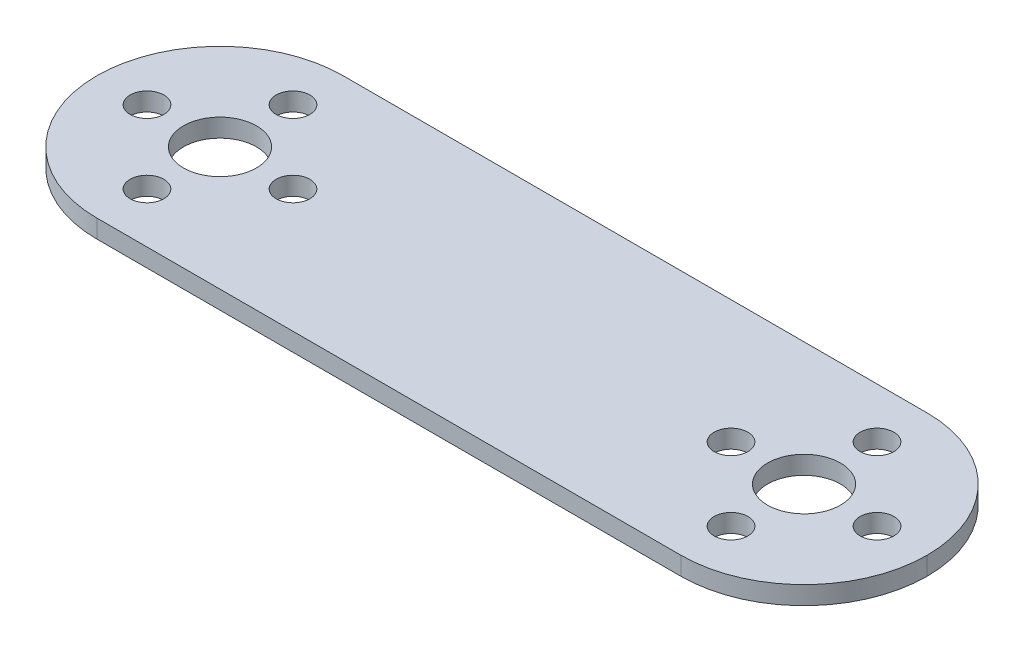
ISO-10303-21;
HEADER;
FILE_DESCRIPTION(('STEP AP214'),'2;1');
FILE_NAME('part.step','',(''),(''),'','','');
FILE_SCHEMA(('AUTOMOTIVE_DESIGN { 1 0 10303 214 1 1 1 1 }'));
ENDSEC;
DATA;
#1=APPLICATION_CONTEXT('core data for automotive mechanical design processes');
#2=APPLICATION_PROTOCOL_DEFINITION('international standard','automotive_design',2000,#1);
#3=PRODUCT_CONTEXT('',#1,'mechanical');
#4=PRODUCT('Part','Part','',(#3));
#5=PRODUCT_RELATED_PRODUCT_CATEGORY('part','',(#4));
#6=PRODUCT_DEFINITION_FORMATION('','',#4);
#7=PRODUCT_DEFINITION_CONTEXT('part definition',#1,'design');
#8=PRODUCT_DEFINITION('design','',#6,#7);
#9=PRODUCT_DEFINITION_SHAPE('','',#8);
#10=(LENGTH_UNIT() NAMED_UNIT(*) SI_UNIT(.MILLI.,.METRE.));
#11=(NAMED_UNIT(*) PLANE_ANGLE_UNIT() SI_UNIT($,.RADIAN.));
#12=(NAMED_UNIT(*) SI_UNIT($,.STERADIAN.) SOLID_ANGLE_UNIT());
#13=UNCERTAINTY_MEASURE_WITH_UNIT(LENGTH_MEASURE(1.E-05),#10,'distance_accuracy_value','');
#14=(GEOMETRIC_REPRESENTATION_CONTEXT(3) GLOBAL_UNCERTAINTY_ASSIGNED_CONTEXT((#13)) GLOBAL_UNIT_ASSIGNED_CONTEXT((#10,
#11,#12)) REPRESENTATION_CONTEXT('',''));
#15=CARTESIAN_POINT('',(0.,0.,0.));
#16=DIRECTION('',(0.,0.,1.));
#17=DIRECTION('',(1.,0.,0.));
#18=AXIS2_PLACEMENT_3D('',#15,#16,#17);
#19=CARTESIAN_POINT('',(0.,2.,0.));
#20=DIRECTION('',(0.,0.,-1.));
#21=DIRECTION('',(-1.,0.,0.));
#22=AXIS2_PLACEMENT_3D('',#19,#20,#21);
#23=PLANE('',#22);
#24=DIRECTION('',(1.,0.,0.));
#25=VECTOR('',#24,1.);
#26=CARTESIAN_POINT('',(0.,2.,0.));
#27=LINE('',#26,#25);
#28=CARTESIAN_POINT('',(13.5,2.,0.));
#29=VERTEX_POINT('',#28);
#30=CARTESIAN_POINT('',(77.5,2.,0.));
#31=VERTEX_POINT('',#30);
#32=EDGE_CURVE('E110',#29,#31,#27,.T.);
#33=ORIENTED_EDGE('',*,*,#32,.F.);
#34=DIRECTION('',(0.,-1.,0.));
#35=VECTOR('',#34,1.);
#36=CARTESIAN_POINT('',(13.5,2.,0.));
#37=LINE('',#36,#35);
#38=CARTESIAN_POINT('',(13.5,0.,0.));
#39=VERTEX_POINT('',#38);
#40=EDGE_CURVE('E128',#29,#39,#37,.T.);
#41=ORIENTED_EDGE('',*,*,#40,.T.);
#42=DIRECTION('',(1.,0.,0.));
#43=VECTOR('',#42,1.);
#44=CARTESIAN_POINT('',(0.,0.,0.));
#45=LINE('',#44,#43);
#46=CARTESIAN_POINT('',(77.5,0.,0.));
#47=VERTEX_POINT('',#46);
#48=EDGE_CURVE('E130',#39,#47,#45,.T.);
#49=ORIENTED_EDGE('',*,*,#48,.T.);
#50=DIRECTION('',(0.,-1.,0.));
#51=VECTOR('',#50,1.);
#52=CARTESIAN_POINT('',(77.5,2.,0.));
#53=LINE('',#52,#51);
#54=EDGE_CURVE('E104',#47,#31,#53,.F.);
#55=ORIENTED_EDGE('',*,*,#54,.T.);
#56=EDGE_LOOP('',(#33,#41,#49,#55));
#57=FACE_BOUND('',#56,.T.);
#58=ADVANCED_FACE('F31',(#57),#23,.F.);
#59=CARTESIAN_POINT('',(0.,2.,-27.));
#60=DIRECTION('',(0.,0.,1.));
#61=DIRECTION('',(1.,0.,0.));
#62=AXIS2_PLACEMENT_3D('',#59,#60,#61);
#63=PLANE('',#62);
#64=DIRECTION('',(-1.,0.,0.));
#65=VECTOR('',#64,1.);
#66=CARTESIAN_POINT('',(0.,0.,-27.));
#67=LINE('',#66,#65);
#68=CARTESIAN_POINT('',(77.5,0.,-27.));
#69=VERTEX_POINT('',#68);
#70=CARTESIAN_POINT('',(13.5,0.,-27.));
#71=VERTEX_POINT('',#70);
#72=EDGE_CURVE('E89',#69,#71,#67,.T.);
#73=ORIENTED_EDGE('',*,*,#72,.T.);
#74=DIRECTION('',(0.,-1.,0.));
#75=VECTOR('',#74,1.);
#76=CARTESIAN_POINT('',(13.5,2.,-27.));
#77=LINE('',#76,#75);
#78=CARTESIAN_POINT('',(13.5,2.,-27.));
#79=VERTEX_POINT('',#78);
#80=EDGE_CURVE('E124',#71,#79,#77,.F.);
#81=ORIENTED_EDGE('',*,*,#80,.T.);
#82=DIRECTION('',(-1.,0.,0.));
#83=VECTOR('',#82,1.);
#84=CARTESIAN_POINT('',(0.,2.,-27.));
#85=LINE('',#84,#83);
#86=CARTESIAN_POINT('',(77.5,2.,-27.));
#87=VERTEX_POINT('',#86);
#88=EDGE_CURVE('E107',#87,#79,#85,.T.);
#89=ORIENTED_EDGE('',*,*,#88,.F.);
#90=DIRECTION('',(0.,-1.,0.));
#91=VECTOR('',#90,1.);
#92=CARTESIAN_POINT('',(77.5,2.,-27.));
#93=LINE('',#92,#91);
#94=EDGE_CURVE('E95',#87,#69,#93,.T.);
#95=ORIENTED_EDGE('',*,*,#94,.T.);
#96=EDGE_LOOP('',(#73,#81,#89,#95));
#97=FACE_BOUND('',#96,.T.);
#98=ADVANCED_FACE('F214',(#97),#63,.F.);
#99=CARTESIAN_POINT('',(0.,2.,-27.));
#100=DIRECTION('',(0.,-1.,0.));
#101=DIRECTION('',(0.,0.,-1.));
#102=AXIS2_PLACEMENT_3D('',#99,#100,#101);
#103=PLANE('',#102);
#104=CARTESIAN_POINT('',(77.5,2.,-21.5));
#105=DIRECTION('',(0.,1.,0.));
#106=DIRECTION('',(0.,0.,1.));
#107=AXIS2_PLACEMENT_3D('',#104,#105,#106);
#108=CIRCLE('',#107,1.84999999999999);
#109=CARTESIAN_POINT('',(77.5,2.,-19.65));
#110=VERTEX_POINT('',#109);
#111=EDGE_CURVE('E196',#110,#110,#108,.T.);
#112=ORIENTED_EDGE('',*,*,#111,.F.);
#113=EDGE_LOOP('',(#112));
#114=FACE_BOUND('',#113,.T.);
#115=CARTESIAN_POINT('',(77.5,2.,-5.5));
#116=DIRECTION('',(0.,1.,0.));
#117=DIRECTION('',(0.,0.,1.));
#118=AXIS2_PLACEMENT_3D('',#115,#116,#117);
#119=CIRCLE('',#118,1.84999999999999);
#120=CARTESIAN_POINT('',(77.5,2.,-3.65000000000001));
#121=VERTEX_POINT('',#120);
#122=EDGE_CURVE('E190',#121,#121,#119,.T.);
#123=ORIENTED_EDGE('',*,*,#122,.F.);
#124=EDGE_LOOP('',(#123));
#125=FACE_BOUND('',#124,.T.);
#126=CARTESIAN_POINT('',(69.5,2.,-13.5));
#127=DIRECTION('',(0.,1.,0.));
#128=DIRECTION('',(0.,0.,1.));
#129=AXIS2_PLACEMENT_3D('',#126,#127,#128);
#130=CIRCLE('',#129,1.84999999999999);
#131=CARTESIAN_POINT('',(69.5,2.,-11.65));
#132=VERTEX_POINT('',#131);
#133=EDGE_CURVE('E184',#132,#132,#130,.T.);
#134=ORIENTED_EDGE('',*,*,#133,.F.);
#135=EDGE_LOOP('',(#134));
#136=FACE_BOUND('',#135,.T.);
#137=CARTESIAN_POINT('',(85.5,2.,-13.5));
#138=DIRECTION('',(0.,1.,0.));
#139=DIRECTION('',(0.,0.,1.));
#140=AXIS2_PLACEMENT_3D('',#137,#138,#139);
#141=CIRCLE('',#140,1.85);
#142=CARTESIAN_POINT('',(85.5,2.,-11.65));
#143=VERTEX_POINT('',#142);
#144=EDGE_CURVE('E178',#143,#143,#141,.T.);
#145=ORIENTED_EDGE('',*,*,#144,.F.);
#146=EDGE_LOOP('',(#145));
#147=FACE_BOUND('',#146,.T.);
#148=CARTESIAN_POINT('',(77.5,2.,-13.5));
#149=DIRECTION('',(0.,1.,0.));
#150=DIRECTION('',(0.,0.,1.));
#151=AXIS2_PLACEMENT_3D('',#148,#149,#150);
#152=CIRCLE('',#151,4.);
#153=CARTESIAN_POINT('',(77.5,2.,-9.49999999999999));
#154=VERTEX_POINT('',#153);
#155=EDGE_CURVE('E172',#154,#154,#152,.T.);
#156=ORIENTED_EDGE('',*,*,#155,.F.);
#157=EDGE_LOOP('',(#156));
#158=FACE_BOUND('',#157,.T.);
#159=CARTESIAN_POINT('',(13.5,2.,-21.5));
#160=DIRECTION('',(0.,1.,0.));
#161=DIRECTION('',(0.,0.,1.));
#162=AXIS2_PLACEMENT_3D('',#159,#160,#161);
#163=CIRCLE('',#162,1.85);
#164=CARTESIAN_POINT('',(13.5,2.,-19.65));
#165=VERTEX_POINT('',#164);
#166=EDGE_CURVE('E166',#165,#165,#163,.T.);
#167=ORIENTED_EDGE('',*,*,#166,.F.);
#168=EDGE_LOOP('',(#167));
#169=FACE_BOUND('',#168,.T.);
#170=CARTESIAN_POINT('',(13.5,2.,-5.5));
#171=DIRECTION('',(0.,1.,0.));
#172=DIRECTION('',(0.,0.,1.));
#173=AXIS2_PLACEMENT_3D('',#170,#171,#172);
#174=CIRCLE('',#173,1.85);
#175=CARTESIAN_POINT('',(13.5,2.,-3.65));
#176=VERTEX_POINT('',#175);
#177=EDGE_CURVE('E160',#176,#176,#174,.T.);
#178=ORIENTED_EDGE('',*,*,#177,.F.);
#179=EDGE_LOOP('',(#178));
#180=FACE_BOUND('',#179,.T.);
#181=CARTESIAN_POINT('',(5.5,2.,-13.5));
#182=DIRECTION('',(0.,1.,0.));
#183=DIRECTION('',(0.,0.,1.));
#184=AXIS2_PLACEMENT_3D('',#181,#182,#183);
#185=CIRCLE('',#184,1.85);
#186=CARTESIAN_POINT('',(5.5,2.,-11.65));
#187=VERTEX_POINT('',#186);
#188=EDGE_CURVE('E154',#187,#187,#185,.T.);
#189=ORIENTED_EDGE('',*,*,#188,.F.);
#190=EDGE_LOOP('',(#189));
#191=FACE_BOUND('',#190,.T.);
#192=CARTESIAN_POINT('',(21.5,2.,-13.5));
#193=DIRECTION('',(0.,1.,0.));
#194=DIRECTION('',(0.,0.,1.));
#195=AXIS2_PLACEMENT_3D('',#192,#193,#194);
#196=CIRCLE('',#195,1.85);
#197=CARTESIAN_POINT('',(21.5,2.,-11.65));
#198=VERTEX_POINT('',#197);
#199=EDGE_CURVE('E148',#198,#198,#196,.T.);
#200=ORIENTED_EDGE('',*,*,#199,.F.);
#201=EDGE_LOOP('',(#200));
#202=FACE_BOUND('',#201,.T.);
#203=CARTESIAN_POINT('',(13.5,2.,-13.5));
#204=DIRECTION('',(0.,1.,0.));
#205=DIRECTION('',(0.,0.,1.));
#206=AXIS2_PLACEMENT_3D('',#203,#204,#205);
#207=CIRCLE('',#206,4.);
#208=CARTESIAN_POINT('',(13.5,2.,-9.49999999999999));
#209=VERTEX_POINT('',#208);
#210=EDGE_CURVE('E139',#209,#209,#207,.T.);
#211=ORIENTED_EDGE('',*,*,#210,.F.);
#212=EDGE_LOOP('',(#211));
#213=FACE_BOUND('',#212,.T.);
#214=CARTESIAN_POINT('',(13.5,2.,-13.5));
#215=DIRECTION('',(0.,-1.,0.));
#216=DIRECTION('',(0.,0.,-1.));
#217=AXIS2_PLACEMENT_3D('',#214,#215,#216);
#218=CIRCLE('',#217,13.5);
#219=CARTESIAN_POINT('',(0.,2.,-13.5));
#220=VERTEX_POINT('',#219);
#221=EDGE_CURVE('E126',#79,#220,#218,.F.);
#222=ORIENTED_EDGE('',*,*,#221,.T.);
#223=CARTESIAN_POINT('',(13.5,2.,-13.5));
#224=DIRECTION('',(0.,-1.,0.));
#225=DIRECTION('',(0.,0.,-1.));
#226=AXIS2_PLACEMENT_3D('',#223,#224,#225);
#227=CIRCLE('',#226,13.5);
#228=EDGE_CURVE('E11',#220,#29,#227,.F.);
#229=ORIENTED_EDGE('',*,*,#228,.T.);
#230=ORIENTED_EDGE('',*,*,#32,.T.);
#231=CARTESIAN_POINT('',(77.5,2.,-13.5));
#232=DIRECTION('',(0.,-1.,0.));
#233=DIRECTION('',(0.,0.,-1.));
#234=AXIS2_PLACEMENT_3D('',#231,#232,#233);
#235=CIRCLE('',#234,13.5);
#236=CARTESIAN_POINT('',(91.,2.,-13.5));
#237=VERTEX_POINT('',#236);
#238=EDGE_CURVE('E116',#31,#237,#235,.F.);
#239=ORIENTED_EDGE('',*,*,#238,.T.);
#240=CARTESIAN_POINT('',(77.5,2.,-13.5));
#241=DIRECTION('',(0.,-1.,0.));
#242=DIRECTION('',(0.,0.,-1.));
#243=AXIS2_PLACEMENT_3D('',#240,#241,#242);
#244=CIRCLE('',#243,13.5);
#245=EDGE_CURVE('E94',#237,#87,#244,.F.);
#246=ORIENTED_EDGE('',*,*,#245,.T.);
#247=ORIENTED_EDGE('',*,*,#88,.T.);
#248=EDGE_LOOP('',(#222,#229,#230,#239,#246,#247));
#249=FACE_BOUND('',#248,.T.);
#250=ADVANCED_FACE('F211',(#114,#125,#136,#147,#158,#169,#180,#191,#202,#213,#249),#103,.F.);
#251=CARTESIAN_POINT('',(0.,0.,-27.));
#252=DIRECTION('',(0.,-1.,0.));
#253=DIRECTION('',(0.,0.,-1.));
#254=AXIS2_PLACEMENT_3D('',#251,#252,#253);
#255=PLANE('',#254);
#256=CARTESIAN_POINT('',(77.5,0.,-21.5));
#257=DIRECTION('',(0.,1.,0.));
#258=DIRECTION('',(0.,0.,1.));
#259=AXIS2_PLACEMENT_3D('',#256,#257,#258);
#260=CIRCLE('',#259,1.84999999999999);
#261=CARTESIAN_POINT('',(77.5,0.,-19.65));
#262=VERTEX_POINT('',#261);
#263=EDGE_CURVE('E193',#262,#262,#260,.T.);
#264=ORIENTED_EDGE('',*,*,#263,.T.);
#265=EDGE_LOOP('',(#264));
#266=FACE_BOUND('',#265,.T.);
#267=CARTESIAN_POINT('',(77.5,0.,-5.5));
#268=DIRECTION('',(0.,1.,0.));
#269=DIRECTION('',(0.,0.,1.));
#270=AXIS2_PLACEMENT_3D('',#267,#268,#269);
#271=CIRCLE('',#270,1.84999999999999);
#272=CARTESIAN_POINT('',(77.5,0.,-3.65000000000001));
#273=VERTEX_POINT('',#272);
#274=EDGE_CURVE('E187',#273,#273,#271,.T.);
#275=ORIENTED_EDGE('',*,*,#274,.T.);
#276=EDGE_LOOP('',(#275));
#277=FACE_BOUND('',#276,.T.);
#278=CARTESIAN_POINT('',(69.5,0.,-13.5));
#279=DIRECTION('',(0.,1.,0.));
#280=DIRECTION('',(0.,0.,1.));
#281=AXIS2_PLACEMENT_3D('',#278,#279,#280);
#282=CIRCLE('',#281,1.84999999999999);
#283=CARTESIAN_POINT('',(69.5,0.,-11.65));
#284=VERTEX_POINT('',#283);
#285=EDGE_CURVE('E181',#284,#284,#282,.T.);
#286=ORIENTED_EDGE('',*,*,#285,.T.);
#287=EDGE_LOOP('',(#286));
#288=FACE_BOUND('',#287,.T.);
#289=CARTESIAN_POINT('',(85.5,0.,-13.5));
#290=DIRECTION('',(0.,1.,0.));
#291=DIRECTION('',(0.,0.,1.));
#292=AXIS2_PLACEMENT_3D('',#289,#290,#291);
#293=CIRCLE('',#292,1.85);
#294=CARTESIAN_POINT('',(85.5,0.,-11.65));
#295=VERTEX_POINT('',#294);
#296=EDGE_CURVE('E175',#295,#295,#293,.T.);
#297=ORIENTED_EDGE('',*,*,#296,.T.);
#298=EDGE_LOOP('',(#297));
#299=FACE_BOUND('',#298,.T.);
#300=CARTESIAN_POINT('',(77.5,0.,-13.5));
#301=DIRECTION('',(0.,1.,0.));
#302=DIRECTION('',(0.,0.,1.));
#303=AXIS2_PLACEMENT_3D('',#300,#301,#302);
#304=CIRCLE('',#303,4.);
#305=CARTESIAN_POINT('',(77.5,0.,-9.49999999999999));
#306=VERTEX_POINT('',#305);
#307=EDGE_CURVE('E169',#306,#306,#304,.T.);
#308=ORIENTED_EDGE('',*,*,#307,.T.);
#309=EDGE_LOOP('',(#308));
#310=FACE_BOUND('',#309,.T.);
#311=CARTESIAN_POINT('',(13.5,0.,-21.5));
#312=DIRECTION('',(0.,1.,0.));
#313=DIRECTION('',(0.,0.,1.));
#314=AXIS2_PLACEMENT_3D('',#311,#312,#313);
#315=CIRCLE('',#314,1.85);
#316=CARTESIAN_POINT('',(13.5,0.,-19.65));
#317=VERTEX_POINT('',#316);
#318=EDGE_CURVE('E163',#317,#317,#315,.T.);
#319=ORIENTED_EDGE('',*,*,#318,.T.);
#320=EDGE_LOOP('',(#319));
#321=FACE_BOUND('',#320,.T.);
#322=CARTESIAN_POINT('',(13.5,0.,-5.5));
#323=DIRECTION('',(0.,1.,0.));
#324=DIRECTION('',(0.,0.,1.));
#325=AXIS2_PLACEMENT_3D('',#322,#323,#324);
#326=CIRCLE('',#325,1.85);
#327=CARTESIAN_POINT('',(13.5,0.,-3.65));
#328=VERTEX_POINT('',#327);
#329=EDGE_CURVE('E157',#328,#328,#326,.T.);
#330=ORIENTED_EDGE('',*,*,#329,.T.);
#331=EDGE_LOOP('',(#330));
#332=FACE_BOUND('',#331,.T.);
#333=CARTESIAN_POINT('',(5.5,0.,-13.5));
#334=DIRECTION('',(0.,1.,0.));
#335=DIRECTION('',(0.,0.,1.));
#336=AXIS2_PLACEMENT_3D('',#333,#334,#335);
#337=CIRCLE('',#336,1.85);
#338=CARTESIAN_POINT('',(5.5,0.,-11.65));
#339=VERTEX_POINT('',#338);
#340=EDGE_CURVE('E151',#339,#339,#337,.T.);
#341=ORIENTED_EDGE('',*,*,#340,.T.);
#342=EDGE_LOOP('',(#341));
#343=FACE_BOUND('',#342,.T.);
#344=CARTESIAN_POINT('',(21.5,0.,-13.5));
#345=DIRECTION('',(0.,1.,0.));
#346=DIRECTION('',(0.,0.,1.));
#347=AXIS2_PLACEMENT_3D('',#344,#345,#346);
#348=CIRCLE('',#347,1.85);
#349=CARTESIAN_POINT('',(21.5,0.,-11.65));
#350=VERTEX_POINT('',#349);
#351=EDGE_CURVE('E146',#350,#350,#348,.T.);
#352=ORIENTED_EDGE('',*,*,#351,.T.);
#353=EDGE_LOOP('',(#352));
#354=FACE_BOUND('',#353,.T.);
#355=CARTESIAN_POINT('',(13.5,0.,-13.5));
#356=DIRECTION('',(0.,1.,0.));
#357=DIRECTION('',(0.,0.,1.));
#358=AXIS2_PLACEMENT_3D('',#355,#356,#357);
#359=CIRCLE('',#358,4.);
#360=CARTESIAN_POINT('',(13.5,0.,-9.49999999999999));
#361=VERTEX_POINT('',#360);
#362=EDGE_CURVE('E141',#361,#361,#359,.T.);
#363=ORIENTED_EDGE('',*,*,#362,.T.);
#364=EDGE_LOOP('',(#363));
#365=FACE_BOUND('',#364,.T.);
#366=ORIENTED_EDGE('',*,*,#48,.F.);
#367=CARTESIAN_POINT('',(13.5,0.,-13.5));
#368=DIRECTION('',(0.,-1.,0.));
#369=DIRECTION('',(0.,0.,-1.));
#370=AXIS2_PLACEMENT_3D('',#367,#368,#369);
#371=CIRCLE('',#370,13.5);
#372=CARTESIAN_POINT('',(0.,0.,-13.5));
#373=VERTEX_POINT('',#372);
#374=EDGE_CURVE('E39',#39,#373,#371,.T.);
#375=ORIENTED_EDGE('',*,*,#374,.T.);
#376=CARTESIAN_POINT('',(13.5,0.,-13.5));
#377=DIRECTION('',(0.,-1.,0.));
#378=DIRECTION('',(0.,0.,-1.));
#379=AXIS2_PLACEMENT_3D('',#376,#377,#378);
#380=CIRCLE('',#379,13.5);
#381=EDGE_CURVE('E122',#373,#71,#380,.T.);
#382=ORIENTED_EDGE('',*,*,#381,.T.);
#383=ORIENTED_EDGE('',*,*,#72,.F.);
#384=CARTESIAN_POINT('',(77.5,0.,-13.5));
#385=DIRECTION('',(0.,-1.,0.));
#386=DIRECTION('',(0.,0.,-1.));
#387=AXIS2_PLACEMENT_3D('',#384,#385,#386);
#388=CIRCLE('',#387,13.5);
#389=CARTESIAN_POINT('',(91.,0.,-13.5));
#390=VERTEX_POINT('',#389);
#391=EDGE_CURVE('E82',#69,#390,#388,.T.);
#392=ORIENTED_EDGE('',*,*,#391,.T.);
#393=CARTESIAN_POINT('',(77.5,0.,-13.5));
#394=DIRECTION('',(0.,-1.,0.));
#395=DIRECTION('',(0.,0.,-1.));
#396=AXIS2_PLACEMENT_3D('',#393,#394,#395);
#397=CIRCLE('',#396,13.5);
#398=EDGE_CURVE('E86',#390,#47,#397,.T.);
#399=ORIENTED_EDGE('',*,*,#398,.T.);
#400=EDGE_LOOP('',(#366,#375,#382,#383,#392,#399));
#401=FACE_BOUND('',#400,.T.);
#402=ADVANCED_FACE('F85',(#266,#277,#288,#299,#310,#321,#332,#343,#354,#365,#401),#255,.T.);
#403=CARTESIAN_POINT('',(13.5,0.,-13.5));
#404=DIRECTION('',(0.,1.,0.));
#405=DIRECTION('',(0.,0.,1.));
#406=AXIS2_PLACEMENT_3D('',#403,#404,#405);
#407=CYLINDRICAL_SURFACE('',#406,4.);
#408=ORIENTED_EDGE('',*,*,#362,.F.);
#409=EDGE_LOOP('',(#408));
#410=FACE_BOUND('',#409,.T.);
#411=ORIENTED_EDGE('',*,*,#210,.T.);
#412=EDGE_LOOP('',(#411));
#413=FACE_BOUND('',#412,.T.);
#414=ADVANCED_FACE('F266',(#410,#413),#407,.F.);
#415=CARTESIAN_POINT('',(21.5,0.,-13.5));
#416=DIRECTION('',(0.,1.,0.));
#417=DIRECTION('',(0.,0.,1.));
#418=AXIS2_PLACEMENT_3D('',#415,#416,#417);
#419=CYLINDRICAL_SURFACE('',#418,1.85);
#420=ORIENTED_EDGE('',*,*,#351,.F.);
#421=EDGE_LOOP('',(#420));
#422=FACE_BOUND('',#421,.T.);
#423=ORIENTED_EDGE('',*,*,#199,.T.);
#424=EDGE_LOOP('',(#423));
#425=FACE_BOUND('',#424,.T.);
#426=ADVANCED_FACE('F369',(#422,#425),#419,.F.);
#427=CARTESIAN_POINT('',(5.5,0.,-13.5));
#428=DIRECTION('',(0.,1.,0.));
#429=DIRECTION('',(0.,0.,1.));
#430=AXIS2_PLACEMENT_3D('',#427,#428,#429);
#431=CYLINDRICAL_SURFACE('',#430,1.85);
#432=ORIENTED_EDGE('',*,*,#340,.F.);
#433=EDGE_LOOP('',(#432));
#434=FACE_BOUND('',#433,.T.);
#435=ORIENTED_EDGE('',*,*,#188,.T.);
#436=EDGE_LOOP('',(#435));
#437=FACE_BOUND('',#436,.T.);
#438=ADVANCED_FACE('F359',(#434,#437),#431,.F.);
#439=CARTESIAN_POINT('',(13.5,0.,-5.5));
#440=DIRECTION('',(0.,1.,0.));
#441=DIRECTION('',(0.,0.,1.));
#442=AXIS2_PLACEMENT_3D('',#439,#440,#441);
#443=CYLINDRICAL_SURFACE('',#442,1.85);
#444=ORIENTED_EDGE('',*,*,#329,.F.);
#445=EDGE_LOOP('',(#444));
#446=FACE_BOUND('',#445,.T.);
#447=ORIENTED_EDGE('',*,*,#177,.T.);
#448=EDGE_LOOP('',(#447));
#449=FACE_BOUND('',#448,.T.);
#450=ADVANCED_FACE('F349',(#446,#449),#443,.F.);
#451=CARTESIAN_POINT('',(13.5,0.,-21.5));
#452=DIRECTION('',(0.,1.,0.));
#453=DIRECTION('',(0.,0.,1.));
#454=AXIS2_PLACEMENT_3D('',#451,#452,#453);
#455=CYLINDRICAL_SURFACE('',#454,1.85);
#456=ORIENTED_EDGE('',*,*,#318,.F.);
#457=EDGE_LOOP('',(#456));
#458=FACE_BOUND('',#457,.T.);
#459=ORIENTED_EDGE('',*,*,#166,.T.);
#460=EDGE_LOOP('',(#459));
#461=FACE_BOUND('',#460,.T.);
#462=ADVANCED_FACE('F339',(#458,#461),#455,.F.);
#463=CARTESIAN_POINT('',(77.5,0.,-13.5));
#464=DIRECTION('',(0.,1.,0.));
#465=DIRECTION('',(0.,0.,1.));
#466=AXIS2_PLACEMENT_3D('',#463,#464,#465);
#467=CYLINDRICAL_SURFACE('',#466,4.);
#468=ORIENTED_EDGE('',*,*,#307,.F.);
#469=EDGE_LOOP('',(#468));
#470=FACE_BOUND('',#469,.T.);
#471=ORIENTED_EDGE('',*,*,#155,.T.);
#472=EDGE_LOOP('',(#471));
#473=FACE_BOUND('',#472,.T.);
#474=ADVANCED_FACE('F329',(#470,#473),#467,.F.);
#475=CARTESIAN_POINT('',(85.5,0.,-13.5));
#476=DIRECTION('',(0.,1.,0.));
#477=DIRECTION('',(0.,0.,1.));
#478=AXIS2_PLACEMENT_3D('',#475,#476,#477);
#479=CYLINDRICAL_SURFACE('',#478,1.85);
#480=ORIENTED_EDGE('',*,*,#296,.F.);
#481=EDGE_LOOP('',(#480));
#482=FACE_BOUND('',#481,.T.);
#483=ORIENTED_EDGE('',*,*,#144,.T.);
#484=EDGE_LOOP('',(#483));
#485=FACE_BOUND('',#484,.T.);
#486=ADVANCED_FACE('F319',(#482,#485),#479,.F.);
#487=CARTESIAN_POINT('',(69.5,0.,-13.5));
#488=DIRECTION('',(0.,1.,0.));
#489=DIRECTION('',(0.,0.,1.));
#490=AXIS2_PLACEMENT_3D('',#487,#488,#489);
#491=CYLINDRICAL_SURFACE('',#490,1.84999999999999);
#492=ORIENTED_EDGE('',*,*,#285,.F.);
#493=EDGE_LOOP('',(#492));
#494=FACE_BOUND('',#493,.T.);
#495=ORIENTED_EDGE('',*,*,#133,.T.);
#496=EDGE_LOOP('',(#495));
#497=FACE_BOUND('',#496,.T.);
#498=ADVANCED_FACE('F309',(#494,#497),#491,.F.);
#499=CARTESIAN_POINT('',(77.5,0.,-5.5));
#500=DIRECTION('',(0.,1.,0.));
#501=DIRECTION('',(0.,0.,1.));
#502=AXIS2_PLACEMENT_3D('',#499,#500,#501);
#503=CYLINDRICAL_SURFACE('',#502,1.84999999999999);
#504=ORIENTED_EDGE('',*,*,#274,.F.);
#505=EDGE_LOOP('',(#504));
#506=FACE_BOUND('',#505,.T.);
#507=ORIENTED_EDGE('',*,*,#122,.T.);
#508=EDGE_LOOP('',(#507));
#509=FACE_BOUND('',#508,.T.);
#510=ADVANCED_FACE('F207',(#506,#509),#503,.F.);
#511=CARTESIAN_POINT('',(77.5,0.,-21.5));
#512=DIRECTION('',(0.,1.,0.));
#513=DIRECTION('',(0.,0.,1.));
#514=AXIS2_PLACEMENT_3D('',#511,#512,#513);
#515=CYLINDRICAL_SURFACE('',#514,1.84999999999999);
#516=ORIENTED_EDGE('',*,*,#263,.F.);
#517=EDGE_LOOP('',(#516));
#518=FACE_BOUND('',#517,.T.);
#519=ORIENTED_EDGE('',*,*,#111,.T.);
#520=EDGE_LOOP('',(#519));
#521=FACE_BOUND('',#520,.T.);
#522=ADVANCED_FACE('F204',(#518,#521),#515,.F.);
#523=CARTESIAN_POINT('',(77.5,2.,-13.5));
#524=DIRECTION('',(0.,-1.,0.));
#525=DIRECTION('',(0.,0.,-1.));
#526=AXIS2_PLACEMENT_3D('',#523,#524,#525);
#527=CYLINDRICAL_SURFACE('',#526,13.5);
#528=ORIENTED_EDGE('',*,*,#238,.F.);
#529=ORIENTED_EDGE('',*,*,#54,.F.);
#530=ORIENTED_EDGE('',*,*,#398,.F.);
#531=DIRECTION('',(0.,-1.,0.));
#532=VECTOR('',#531,1.);
#533=CARTESIAN_POINT('',(91.,2.,-13.5));
#534=LINE('',#533,#532);
#535=EDGE_CURVE('E101',#237,#390,#534,.T.);
#536=ORIENTED_EDGE('',*,*,#535,.F.);
#537=EDGE_LOOP('',(#528,#529,#530,#536));
#538=FACE_BOUND('',#537,.T.);
#539=ADVANCED_FACE('F100',(#538),#527,.T.);
#540=CARTESIAN_POINT('',(77.5,2.,-13.5));
#541=DIRECTION('',(0.,-1.,0.));
#542=DIRECTION('',(0.,0.,-1.));
#543=AXIS2_PLACEMENT_3D('',#540,#541,#542);
#544=CYLINDRICAL_SURFACE('',#543,13.5);
#545=ORIENTED_EDGE('',*,*,#245,.F.);
#546=ORIENTED_EDGE('',*,*,#535,.T.);
#547=ORIENTED_EDGE('',*,*,#391,.F.);
#548=ORIENTED_EDGE('',*,*,#94,.F.);
#549=EDGE_LOOP('',(#545,#546,#547,#548));
#550=FACE_BOUND('',#549,.T.);
#551=ADVANCED_FACE('F106',(#550),#544,.T.);
#552=CARTESIAN_POINT('',(13.5,2.,-13.5));
#553=DIRECTION('',(0.,-1.,0.));
#554=DIRECTION('',(0.,0.,-1.));
#555=AXIS2_PLACEMENT_3D('',#552,#553,#554);
#556=CYLINDRICAL_SURFACE('',#555,13.5);
#557=ORIENTED_EDGE('',*,*,#221,.F.);
#558=ORIENTED_EDGE('',*,*,#80,.F.);
#559=ORIENTED_EDGE('',*,*,#381,.F.);
#560=DIRECTION('',(0.,-1.,0.));
#561=VECTOR('',#560,1.);
#562=CARTESIAN_POINT('',(0.,2.,-13.5));
#563=LINE('',#562,#561);
#564=EDGE_CURVE('E120',#220,#373,#563,.T.);
#565=ORIENTED_EDGE('',*,*,#564,.F.);
#566=EDGE_LOOP('',(#557,#558,#559,#565));
#567=FACE_BOUND('',#566,.T.);
#568=ADVANCED_FACE('F135',(#567),#556,.T.);
#569=CARTESIAN_POINT('',(13.5,2.,-13.5));
#570=DIRECTION('',(0.,-1.,0.));
#571=DIRECTION('',(0.,0.,-1.));
#572=AXIS2_PLACEMENT_3D('',#569,#570,#571);
#573=CYLINDRICAL_SURFACE('',#572,13.5);
#574=ORIENTED_EDGE('',*,*,#228,.F.);
#575=ORIENTED_EDGE('',*,*,#564,.T.);
#576=ORIENTED_EDGE('',*,*,#374,.F.);
#577=ORIENTED_EDGE('',*,*,#40,.F.);
#578=EDGE_LOOP('',(#574,#575,#576,#577));
#579=FACE_BOUND('',#578,.T.);
#580=ADVANCED_FACE('F33',(#579),#573,.T.);
#581=CLOSED_SHELL('',(#58,#98,#250,#402,#414,#426,#438,#450,#462,#474,#486,#498,#510,#522,#539,
#551,#568,#580));
#582=MANIFOLD_SOLID_BREP('B2',#581);
#583=ADVANCED_BREP_SHAPE_REPRESENTATION('',(#18,#582),#14);
#584=SHAPE_DEFINITION_REPRESENTATION(#9,#583);
ENDSEC;
END-ISO-10303-21;
